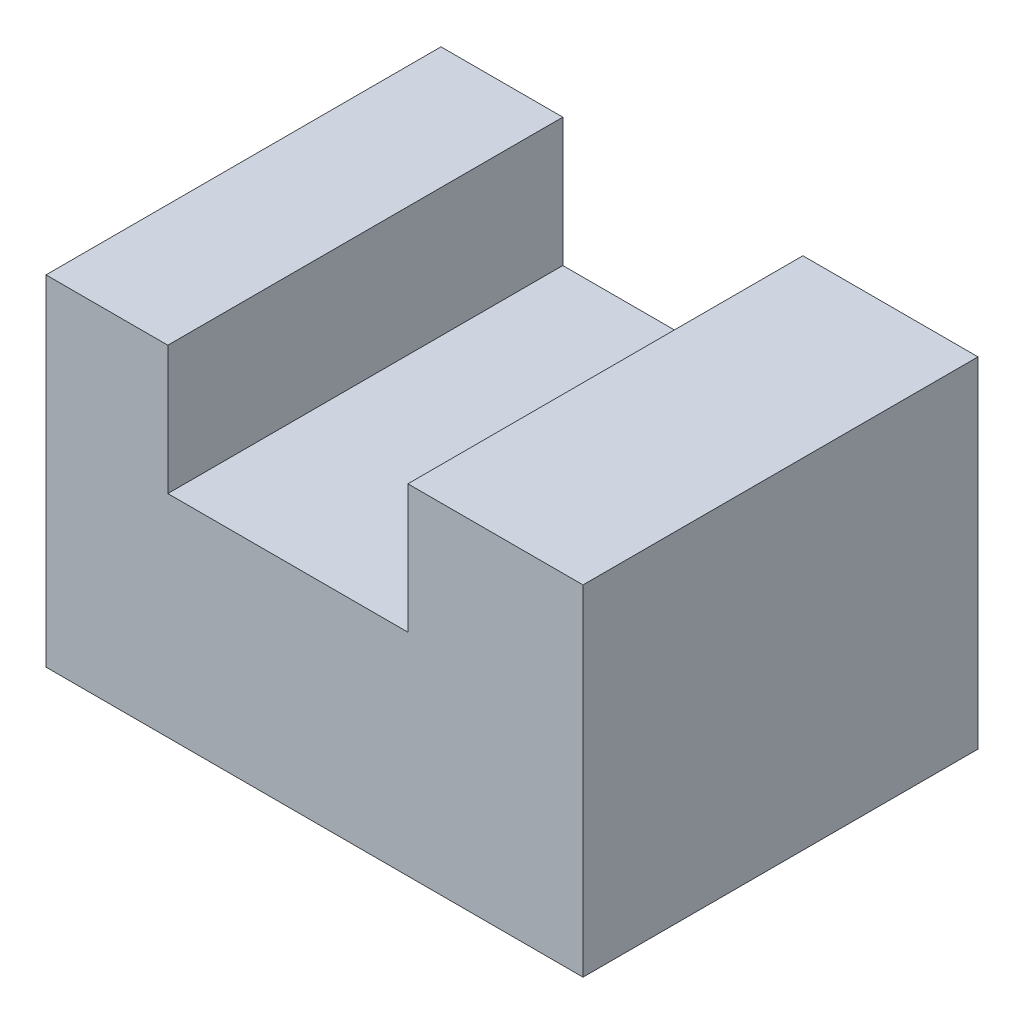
from build123d import *

# Parameters (mm, degrees)
SKETCH_1_W          = 52.162890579
SKETCH_1_H          = 38.368703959
EXTRUDE_1_DEPTH     = 33
SKETCH_2_W          = 23.318490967
SKETCH_2_H          = 12.481057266
CUT_EXTRUDE_1_DEPTH = 43


with BuildPart() as part:
    # Sketch 1 → Extrude 1 (new body)
    with BuildSketch(Plane(origin=(0, 0, 0), x_dir=(1, 0, 0), z_dir=(0, 1, 0))):
        with Locations((27.472455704, 19.18435198)):
            Rectangle(SKETCH_1_W, SKETCH_1_H)
    extrude(amount=EXTRUDE_1_DEPTH)

    # Sketch 2 → Cut-Extrude 1 (cut)
    with BuildSketch(Plane.XY):
        with Locations((24.884442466, 26.759471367)):
            Rectangle(SKETCH_2_W, SKETCH_2_H)
    extrude(amount=-CUT_EXTRUDE_1_DEPTH, mode=Mode.SUBTRACT)


solid = part.part
